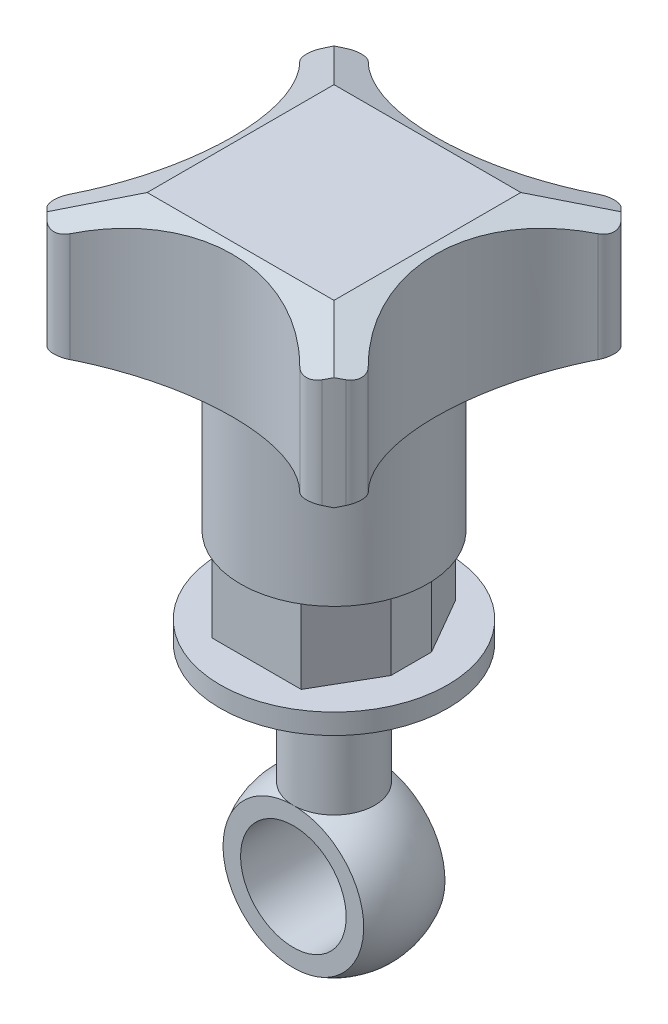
ISO-10303-21;
HEADER;
FILE_DESCRIPTION(('STEP AP214'),'2;1');
FILE_NAME('part.step','',(''),(''),'','','');
FILE_SCHEMA(('AUTOMOTIVE_DESIGN { 1 0 10303 214 1 1 1 1 }'));
ENDSEC;
DATA;
#1=APPLICATION_CONTEXT('core data for automotive mechanical design processes');
#2=APPLICATION_PROTOCOL_DEFINITION('international standard','automotive_design',2000,#1);
#3=PRODUCT_CONTEXT('',#1,'mechanical');
#4=PRODUCT('Part','Part','',(#3));
#5=PRODUCT_RELATED_PRODUCT_CATEGORY('part','',(#4));
#6=PRODUCT_DEFINITION_FORMATION('','',#4);
#7=PRODUCT_DEFINITION_CONTEXT('part definition',#1,'design');
#8=PRODUCT_DEFINITION('design','',#6,#7);
#9=PRODUCT_DEFINITION_SHAPE('','',#8);
#10=(LENGTH_UNIT() NAMED_UNIT(*) SI_UNIT(.MILLI.,.METRE.));
#11=(NAMED_UNIT(*) PLANE_ANGLE_UNIT() SI_UNIT($,.RADIAN.));
#12=(NAMED_UNIT(*) SI_UNIT($,.STERADIAN.) SOLID_ANGLE_UNIT());
#13=UNCERTAINTY_MEASURE_WITH_UNIT(LENGTH_MEASURE(1.E-05),#10,'distance_accuracy_value','');
#14=(GEOMETRIC_REPRESENTATION_CONTEXT(3) GLOBAL_UNCERTAINTY_ASSIGNED_CONTEXT((#13)) GLOBAL_UNIT_ASSIGNED_CONTEXT((#10,
#11,#12)) REPRESENTATION_CONTEXT('',''));
#15=CARTESIAN_POINT('',(0.,0.,0.));
#16=DIRECTION('',(0.,0.,1.));
#17=DIRECTION('',(1.,0.,0.));
#18=AXIS2_PLACEMENT_3D('',#15,#16,#17);
#19=CARTESIAN_POINT('',(13.5,161.5,-100.));
#20=DIRECTION('',(0.,-1.,0.));
#21=DIRECTION('',(0.,0.,-1.));
#22=AXIS2_PLACEMENT_3D('',#19,#20,#21);
#23=PLANE('',#22);
#24=DIRECTION('',(-0.499481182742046,0.,0.866324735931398));
#25=VECTOR('',#24,1.);
#26=CARTESIAN_POINT('',(30.4601744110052,161.5,-15.5000000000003));
#27=LINE('',#26,#25);
#28=CARTESIAN_POINT('',(34.4999999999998,161.5,-22.5068722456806));
#29=VERTEX_POINT('',#28);
#30=CARTESIAN_POINT('',(30.460174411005,161.5,-15.5));
#31=VERTEX_POINT('',#30);
#32=EDGE_CURVE('E348',#29,#31,#27,.T.);
#33=ORIENTED_EDGE('',*,*,#32,.F.);
#34=DIRECTION('',(0.,0.,1.));
#35=VECTOR('',#34,1.);
#36=CARTESIAN_POINT('',(34.4999999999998,161.5,-99.9999999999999));
#37=LINE('',#36,#35);
#38=CARTESIAN_POINT('',(34.5,161.5,-27.5076538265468));
#39=VERTEX_POINT('',#38);
#40=EDGE_CURVE('E428',#39,#29,#37,.T.);
#41=ORIENTED_EDGE('',*,*,#40,.F.);
#42=DIRECTION('',(0.50025934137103,0.,0.865875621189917));
#43=VECTOR('',#42,1.);
#44=CARTESIAN_POINT('',(35.943100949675,161.5,-25.0098575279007));
#45=LINE('',#44,#43);
#46=CARTESIAN_POINT('',(30.4601744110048,161.5,-34.5));
#47=VERTEX_POINT('',#46);
#48=EDGE_CURVE('E353',#47,#39,#45,.T.);
#49=ORIENTED_EDGE('',*,*,#48,.F.);
#50=DIRECTION('',(-1.,0.,0.));
#51=VECTOR('',#50,1.);
#52=CARTESIAN_POINT('',(200.,161.5,-34.5));
#53=LINE('',#52,#51);
#54=CARTESIAN_POINT('',(19.477243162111,161.5,-34.5));
#55=VERTEX_POINT('',#54);
#56=EDGE_CURVE('E388',#47,#55,#53,.T.);
#57=ORIENTED_EDGE('',*,*,#56,.T.);
#58=DIRECTION('',(0.499481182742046,0.,-0.866324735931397));
#59=VECTOR('',#58,1.);
#60=CARTESIAN_POINT('',(19.4800841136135,161.5,-34.5049274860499));
#61=LINE('',#60,#59);
#62=CARTESIAN_POINT('',(15.4999999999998,161.5,-27.601673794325));
#63=VERTEX_POINT('',#62);
#64=EDGE_CURVE('E566',#63,#55,#61,.T.);
#65=ORIENTED_EDGE('',*,*,#64,.F.);
#66=DIRECTION('',(0.,0.,1.));
#67=VECTOR('',#66,1.);
#68=CARTESIAN_POINT('',(15.4999999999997,161.5,-100.));
#69=LINE('',#68,#67);
#70=CARTESIAN_POINT('',(15.5,161.5,-22.40371978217));
#71=VERTEX_POINT('',#70);
#72=EDGE_CURVE('E438',#63,#71,#69,.T.);
#73=ORIENTED_EDGE('',*,*,#72,.T.);
#74=DIRECTION('',(-0.50025934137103,0.,-0.865875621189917));
#75=VECTOR('',#74,1.);
#76=CARTESIAN_POINT('',(13.9999999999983,161.5,-24.9999999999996));
#77=LINE('',#76,#75);
#78=CARTESIAN_POINT('',(19.4886217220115,161.5,-15.4999999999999));
#79=VERTEX_POINT('',#78);
#80=EDGE_CURVE('E570',#79,#71,#77,.T.);
#81=ORIENTED_EDGE('',*,*,#80,.F.);
#82=DIRECTION('',(-1.,0.,0.));
#83=VECTOR('',#82,1.);
#84=CARTESIAN_POINT('',(200.,161.5,-15.5000000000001));
#85=LINE('',#84,#83);
#86=EDGE_CURVE('E359',#31,#79,#85,.T.);
#87=ORIENTED_EDGE('',*,*,#86,.F.);
#88=EDGE_LOOP('',(#33,#41,#49,#57,#65,#73,#81,#87));
#89=FACE_BOUND('',#88,.T.);
#90=CARTESIAN_POINT('',(24.9999999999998,161.5,-25.));
#91=DIRECTION('',(0.,-1.,0.));
#92=DIRECTION('',(0.,0.,-1.));
#93=AXIS2_PLACEMENT_3D('',#90,#91,#92);
#94=CIRCLE('',#93,11.5);
#95=CARTESIAN_POINT('',(24.9999999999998,161.5,-36.5));
#96=VERTEX_POINT('',#95);
#97=EDGE_CURVE('E515',#96,#96,#94,.T.);
#98=ORIENTED_EDGE('',*,*,#97,.T.);
#99=EDGE_LOOP('',(#98));
#100=FACE_BOUND('',#99,.T.);
#101=ADVANCED_FACE('F101',(#89,#100),#23,.T.);
#102=CARTESIAN_POINT('',(34.4999999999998,161.5,-99.9999999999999));
#103=DIRECTION('',(1.,0.,0.));
#104=DIRECTION('',(0.,0.,-1.));
#105=AXIS2_PLACEMENT_3D('',#102,#103,#104);
#106=PLANE('',#105);
#107=DIRECTION('',(0.,1.,0.));
#108=VECTOR('',#107,1.);
#109=CARTESIAN_POINT('',(34.4999999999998,161.499999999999,-22.5068722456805));
#110=LINE('',#109,#108);
#111=CARTESIAN_POINT('',(34.4999999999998,152.,-22.5068722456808));
#112=VERTEX_POINT('',#111);
#113=EDGE_CURVE('E580',#112,#29,#110,.T.);
#114=ORIENTED_EDGE('',*,*,#113,.F.);
#115=DIRECTION('',(0.,0.,1.));
#116=VECTOR('',#115,1.);
#117=CARTESIAN_POINT('',(34.5,152.,-100.));
#118=LINE('',#117,#116);
#119=CARTESIAN_POINT('',(34.5,152.,-27.5076538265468));
#120=VERTEX_POINT('',#119);
#121=EDGE_CURVE('E337',#120,#112,#118,.T.);
#122=ORIENTED_EDGE('',*,*,#121,.F.);
#123=DIRECTION('',(0.,-1.,0.));
#124=VECTOR('',#123,1.);
#125=CARTESIAN_POINT('',(34.5,161.500000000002,-27.5076538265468));
#126=LINE('',#125,#124);
#127=EDGE_CURVE('E569',#39,#120,#126,.T.);
#128=ORIENTED_EDGE('',*,*,#127,.F.);
#129=ORIENTED_EDGE('',*,*,#40,.T.);
#130=EDGE_LOOP('',(#114,#122,#128,#129));
#131=FACE_BOUND('',#130,.T.);
#132=ADVANCED_FACE('F846',(#131),#106,.T.);
#133=CARTESIAN_POINT('',(15.4999999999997,152.,-100.));
#134=DIRECTION('',(-1.,0.,0.));
#135=DIRECTION('',(0.,0.,1.));
#136=AXIS2_PLACEMENT_3D('',#133,#134,#135);
#137=PLANE('',#136);
#138=DIRECTION('',(0.,1.,0.));
#139=VECTOR('',#138,1.);
#140=CARTESIAN_POINT('',(15.4999999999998,151.999999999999,-27.6016737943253));
#141=LINE('',#140,#139);
#142=CARTESIAN_POINT('',(15.4999999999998,152.,-27.6016737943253));
#143=VERTEX_POINT('',#142);
#144=EDGE_CURVE('E578',#143,#63,#141,.T.);
#145=ORIENTED_EDGE('',*,*,#144,.F.);
#146=DIRECTION('',(0.,0.,1.));
#147=VECTOR('',#146,1.);
#148=CARTESIAN_POINT('',(15.4999999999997,152.,-100.));
#149=LINE('',#148,#147);
#150=CARTESIAN_POINT('',(15.4999999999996,152.,-22.40371978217));
#151=VERTEX_POINT('',#150);
#152=EDGE_CURVE('E434',#143,#151,#149,.T.);
#153=ORIENTED_EDGE('',*,*,#152,.T.);
#154=DIRECTION('',(0.,-1.,0.));
#155=VECTOR('',#154,1.);
#156=CARTESIAN_POINT('',(15.4999999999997,152.000000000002,-22.4037197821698));
#157=LINE('',#156,#155);
#158=EDGE_CURVE('E583',#71,#151,#157,.T.);
#159=ORIENTED_EDGE('',*,*,#158,.F.);
#160=ORIENTED_EDGE('',*,*,#72,.F.);
#161=EDGE_LOOP('',(#145,#153,#159,#160));
#162=FACE_BOUND('',#161,.T.);
#163=ADVANCED_FACE('F852',(#162),#137,.T.);
#164=CARTESIAN_POINT('',(200.,152.,-15.5));
#165=DIRECTION('',(0.,0.,-1.));
#166=DIRECTION('',(-1.,0.,0.));
#167=AXIS2_PLACEMENT_3D('',#164,#165,#166);
#168=PLANE('',#167);
#169=ORIENTED_EDGE('',*,*,#86,.T.);
#170=DIRECTION('',(0.,-1.,0.));
#171=VECTOR('',#170,1.);
#172=CARTESIAN_POINT('',(19.4886217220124,238.965720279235,-15.5));
#173=LINE('',#172,#171);
#174=CARTESIAN_POINT('',(19.4886217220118,152.,-15.4999999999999));
#175=VERTEX_POINT('',#174);
#176=EDGE_CURVE('E354',#79,#175,#173,.T.);
#177=ORIENTED_EDGE('',*,*,#176,.T.);
#178=DIRECTION('',(-1.,0.,0.));
#179=VECTOR('',#178,1.);
#180=CARTESIAN_POINT('',(200.,152.,-15.5));
#181=LINE('',#180,#179);
#182=CARTESIAN_POINT('',(30.4601744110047,152.,-15.4999999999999));
#183=VERTEX_POINT('',#182);
#184=EDGE_CURVE('E334',#183,#175,#181,.T.);
#185=ORIENTED_EDGE('',*,*,#184,.F.);
#186=DIRECTION('',(0.,-1.,0.));
#187=VECTOR('',#186,1.);
#188=CARTESIAN_POINT('',(30.4601744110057,238.965720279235,-15.4999999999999));
#189=LINE('',#188,#187);
#190=EDGE_CURVE('E345',#31,#183,#189,.T.);
#191=ORIENTED_EDGE('',*,*,#190,.F.);
#192=EDGE_LOOP('',(#169,#177,#185,#191));
#193=FACE_BOUND('',#192,.T.);
#194=ADVANCED_FACE('F357',(#193),#168,.F.);
#195=CARTESIAN_POINT('',(200.,161.5,-34.5));
#196=DIRECTION('',(0.,0.,1.));
#197=DIRECTION('',(1.,0.,0.));
#198=AXIS2_PLACEMENT_3D('',#195,#196,#197);
#199=PLANE('',#198);
#200=DIRECTION('',(-1.,0.,0.));
#201=VECTOR('',#200,1.);
#202=CARTESIAN_POINT('',(200.,152.,-34.5));
#203=LINE('',#202,#201);
#204=CARTESIAN_POINT('',(30.4601744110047,152.,-34.5));
#205=VERTEX_POINT('',#204);
#206=CARTESIAN_POINT('',(19.4772431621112,152.,-34.5));
#207=VERTEX_POINT('',#206);
#208=EDGE_CURVE('E392',#205,#207,#203,.T.);
#209=ORIENTED_EDGE('',*,*,#208,.T.);
#210=DIRECTION('',(0.,1.,0.));
#211=VECTOR('',#210,1.);
#212=CARTESIAN_POINT('',(19.477243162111,161.500000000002,-34.5000000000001));
#213=LINE('',#212,#211);
#214=EDGE_CURVE('E13',#207,#55,#213,.T.);
#215=ORIENTED_EDGE('',*,*,#214,.T.);
#216=ORIENTED_EDGE('',*,*,#56,.F.);
#217=DIRECTION('',(0.,-1.,0.));
#218=VECTOR('',#217,1.);
#219=CARTESIAN_POINT('',(30.4601744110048,161.500000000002,-34.5));
#220=LINE('',#219,#218);
#221=EDGE_CURVE('E111',#47,#205,#220,.T.);
#222=ORIENTED_EDGE('',*,*,#221,.T.);
#223=EDGE_LOOP('',(#209,#215,#216,#222));
#224=FACE_BOUND('',#223,.T.);
#225=ADVANCED_FACE('F876',(#224),#199,.F.);
#226=CARTESIAN_POINT('',(35.9431009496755,238.965720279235,-25.0098575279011));
#227=DIRECTION('',(-0.865875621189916,0.,0.50025934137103));
#228=DIRECTION('',(0.50025934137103,0.,0.865875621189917));
#229=AXIS2_PLACEMENT_3D('',#226,#227,#228);
#230=PLANE('',#229);
#231=ORIENTED_EDGE('',*,*,#127,.T.);
#232=DIRECTION('',(-0.50025934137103,0.,-0.865875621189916));
#233=VECTOR('',#232,1.);
#234=CARTESIAN_POINT('',(35.9431009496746,152.,-25.009857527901));
#235=LINE('',#234,#233);
#236=EDGE_CURVE('E341',#120,#205,#235,.T.);
#237=ORIENTED_EDGE('',*,*,#236,.T.);
#238=ORIENTED_EDGE('',*,*,#221,.F.);
#239=ORIENTED_EDGE('',*,*,#48,.T.);
#240=EDGE_LOOP('',(#231,#237,#238,#239));
#241=FACE_BOUND('',#240,.T.);
#242=ADVANCED_FACE('F878',(#241),#230,.F.);
#243=CARTESIAN_POINT('',(19.4800841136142,238.965720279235,-34.5049274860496));
#244=DIRECTION('',(0.866324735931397,0.,0.499481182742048));
#245=DIRECTION('',(0.499481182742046,0.,-0.866324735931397));
#246=AXIS2_PLACEMENT_3D('',#243,#244,#245);
#247=PLANE('',#246);
#248=ORIENTED_EDGE('',*,*,#144,.T.);
#249=ORIENTED_EDGE('',*,*,#64,.T.);
#250=ORIENTED_EDGE('',*,*,#214,.F.);
#251=DIRECTION('',(-0.499481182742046,0.,0.866324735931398));
#252=VECTOR('',#251,1.);
#253=CARTESIAN_POINT('',(19.4800841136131,152.,-34.5049274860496));
#254=LINE('',#253,#252);
#255=EDGE_CURVE('E553',#207,#143,#254,.T.);
#256=ORIENTED_EDGE('',*,*,#255,.T.);
#257=EDGE_LOOP('',(#248,#249,#250,#256));
#258=FACE_BOUND('',#257,.T.);
#259=ADVANCED_FACE('F926',(#258),#247,.F.);
#260=CARTESIAN_POINT('',(13.999999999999,238.965720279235,-25.));
#261=DIRECTION('',(0.865875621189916,0.,-0.50025934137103));
#262=DIRECTION('',(-0.50025934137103,0.,-0.865875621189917));
#263=AXIS2_PLACEMENT_3D('',#260,#261,#262);
#264=PLANE('',#263);
#265=ORIENTED_EDGE('',*,*,#158,.T.);
#266=DIRECTION('',(0.50025934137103,0.,0.865875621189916));
#267=VECTOR('',#266,1.);
#268=CARTESIAN_POINT('',(13.9999999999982,152.,-24.9999999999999));
#269=LINE('',#268,#267);
#270=EDGE_CURVE('E342',#151,#175,#269,.T.);
#271=ORIENTED_EDGE('',*,*,#270,.T.);
#272=ORIENTED_EDGE('',*,*,#176,.F.);
#273=ORIENTED_EDGE('',*,*,#80,.T.);
#274=EDGE_LOOP('',(#265,#271,#272,#273));
#275=FACE_BOUND('',#274,.T.);
#276=ADVANCED_FACE('F930',(#275),#264,.F.);
#277=CARTESIAN_POINT('',(30.4601744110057,238.965720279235,-15.4999999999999));
#278=DIRECTION('',(-0.866324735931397,0.,-0.499481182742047));
#279=DIRECTION('',(-0.499481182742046,0.,0.866324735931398));
#280=AXIS2_PLACEMENT_3D('',#277,#278,#279);
#281=PLANE('',#280);
#282=ORIENTED_EDGE('',*,*,#113,.T.);
#283=ORIENTED_EDGE('',*,*,#32,.T.);
#284=ORIENTED_EDGE('',*,*,#190,.T.);
#285=DIRECTION('',(0.499481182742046,0.,-0.866324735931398));
#286=VECTOR('',#285,1.);
#287=CARTESIAN_POINT('',(30.4601744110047,152.,-15.5));
#288=LINE('',#287,#286);
#289=EDGE_CURVE('E330',#183,#112,#288,.T.);
#290=ORIENTED_EDGE('',*,*,#289,.T.);
#291=EDGE_LOOP('',(#282,#283,#284,#290));
#292=FACE_BOUND('',#291,.T.);
#293=ADVANCED_FACE('F346',(#292),#281,.F.);
#294=CARTESIAN_POINT('',(38.7788461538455,179.5,-25.));
#295=DIRECTION('',(0.,-1.,0.));
#296=DIRECTION('',(0.,0.,-1.));
#297=AXIS2_PLACEMENT_3D('',#294,#295,#296);
#298=PLANE('',#297);
#299=DIRECTION('',(-1.,0.,0.));
#300=VECTOR('',#299,1.);
#301=CARTESIAN_POINT('',(200.,179.5,-13.5));
#302=LINE('',#301,#300);
#303=CARTESIAN_POINT('',(25.,179.5,-13.5));
#304=VERTEX_POINT('',#303);
#305=CARTESIAN_POINT('',(13.5000000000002,179.5,-13.5000000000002));
#306=VERTEX_POINT('',#305);
#307=EDGE_CURVE('E550',#304,#306,#302,.T.);
#308=ORIENTED_EDGE('',*,*,#307,.T.);
#309=DIRECTION('',(0.,0.,1.));
#310=VECTOR('',#309,1.);
#311=CARTESIAN_POINT('',(13.5,179.5,-100.));
#312=LINE('',#311,#310);
#313=CARTESIAN_POINT('',(13.4999999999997,179.5,-25.));
#314=VERTEX_POINT('',#313);
#315=EDGE_CURVE('E546',#314,#306,#312,.T.);
#316=ORIENTED_EDGE('',*,*,#315,.F.);
#317=CARTESIAN_POINT('',(25.,179.5,-24.9999999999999));
#318=DIRECTION('',(0.,-1.,0.));
#319=DIRECTION('',(0.,0.,-1.));
#320=AXIS2_PLACEMENT_3D('',#317,#318,#319);
#321=CIRCLE('',#320,11.5);
#322=EDGE_CURVE('E775',#304,#314,#321,.T.);
#323=ORIENTED_EDGE('',*,*,#322,.F.);
#324=EDGE_LOOP('',(#308,#316,#323));
#325=FACE_BOUND('',#324,.T.);
#326=ADVANCED_FACE('F776',(#325),#298,.T.);
#327=DIRECTION('',(-1.,0.,0.));
#328=VECTOR('',#327,1.);
#329=CARTESIAN_POINT('',(200.,179.5,-13.5));
#330=LINE('',#329,#328);
#331=CARTESIAN_POINT('',(36.4999999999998,179.5,-13.5));
#332=VERTEX_POINT('',#331);
#333=EDGE_CURVE('E365',#332,#304,#330,.T.);
#334=ORIENTED_EDGE('',*,*,#333,.T.);
#335=CARTESIAN_POINT('',(36.4999999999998,179.5,-25.));
#336=VERTEX_POINT('',#335);
#337=EDGE_CURVE('E542',#336,#304,#321,.T.);
#338=ORIENTED_EDGE('',*,*,#337,.F.);
#339=DIRECTION('',(0.,0.,-1.));
#340=VECTOR('',#339,1.);
#341=CARTESIAN_POINT('',(36.4999999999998,179.5,-100.));
#342=LINE('',#341,#340);
#343=EDGE_CURVE('E541',#332,#336,#342,.T.);
#344=ORIENTED_EDGE('',*,*,#343,.F.);
#345=EDGE_LOOP('',(#334,#338,#344));
#346=FACE_BOUND('',#345,.T.);
#347=ADVANCED_FACE('F771',(#346),#298,.T.);
#348=CARTESIAN_POINT('',(24.9999999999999,179.5,-36.5));
#349=VERTEX_POINT('',#348);
#350=EDGE_CURVE('E537',#349,#336,#321,.T.);
#351=ORIENTED_EDGE('',*,*,#350,.F.);
#352=DIRECTION('',(-1.,0.,0.));
#353=VECTOR('',#352,1.);
#354=CARTESIAN_POINT('',(200.,179.5,-36.4999999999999));
#355=LINE('',#354,#353);
#356=CARTESIAN_POINT('',(36.4999999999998,179.5,-36.5));
#357=VERTEX_POINT('',#356);
#358=EDGE_CURVE('E384',#357,#349,#355,.T.);
#359=ORIENTED_EDGE('',*,*,#358,.F.);
#360=DIRECTION('',(0.,0.,1.));
#361=VECTOR('',#360,1.);
#362=CARTESIAN_POINT('',(36.4999999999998,179.5,-100.));
#363=LINE('',#362,#361);
#364=EDGE_CURVE('E425',#357,#336,#363,.T.);
#365=ORIENTED_EDGE('',*,*,#364,.T.);
#366=EDGE_LOOP('',(#351,#359,#365));
#367=FACE_BOUND('',#366,.T.);
#368=ADVANCED_FACE('F795',(#367),#298,.T.);
#369=CARTESIAN_POINT('',(25.,179.5,-24.9999999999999));
#370=DIRECTION('',(0.,-1.,0.));
#371=DIRECTION('',(0.,0.,-1.));
#372=AXIS2_PLACEMENT_3D('',#369,#370,#371);
#373=CYLINDRICAL_SURFACE('',#372,11.5);
#374=ORIENTED_EDGE('',*,*,#97,.F.);
#375=EDGE_LOOP('',(#374));
#376=FACE_BOUND('',#375,.T.);
#377=ORIENTED_EDGE('',*,*,#350,.T.);
#378=ORIENTED_EDGE('',*,*,#337,.T.);
#379=ORIENTED_EDGE('',*,*,#322,.T.);
#380=EDGE_CURVE('E536',#314,#349,#321,.T.);
#381=ORIENTED_EDGE('',*,*,#380,.T.);
#382=EDGE_LOOP('',(#377,#378,#379,#381));
#383=FACE_BOUND('',#382,.T.);
#384=ADVANCED_FACE('F780',(#376,#383),#373,.T.);
#385=CARTESIAN_POINT('',(13.5,179.5,-36.5));
#386=VERTEX_POINT('',#385);
#387=EDGE_CURVE('E383',#349,#386,#355,.T.);
#388=ORIENTED_EDGE('',*,*,#387,.F.);
#389=ORIENTED_EDGE('',*,*,#380,.F.);
#390=DIRECTION('',(0.,0.,1.));
#391=VECTOR('',#390,1.);
#392=CARTESIAN_POINT('',(13.4999999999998,179.5,-100.));
#393=LINE('',#392,#391);
#394=EDGE_CURVE('E442',#386,#314,#393,.T.);
#395=ORIENTED_EDGE('',*,*,#394,.F.);
#396=EDGE_LOOP('',(#388,#389,#395));
#397=FACE_BOUND('',#396,.T.);
#398=ADVANCED_FACE('F786',(#397),#298,.T.);
#399=CARTESIAN_POINT('',(13.4999999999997,197.5,-99.9999999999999));
#400=DIRECTION('',(0.,1.,0.));
#401=DIRECTION('',(0.,0.,1.));
#402=AXIS2_PLACEMENT_3D('',#399,#400,#401);
#403=PLANE('',#402);
#404=DIRECTION('',(-1.,0.,0.));
#405=VECTOR('',#404,1.);
#406=CARTESIAN_POINT('',(200.,197.5,-36.5));
#407=LINE('',#406,#405);
#408=CARTESIAN_POINT('',(36.4999999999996,197.5,-36.5));
#409=VERTEX_POINT('',#408);
#410=CARTESIAN_POINT('',(13.5,197.5,-36.5));
#411=VERTEX_POINT('',#410);
#412=EDGE_CURVE('E379',#409,#411,#407,.T.);
#413=ORIENTED_EDGE('',*,*,#412,.T.);
#414=DIRECTION('',(0.,0.,1.));
#415=VECTOR('',#414,1.);
#416=CARTESIAN_POINT('',(13.4999999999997,197.5,-99.9999999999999));
#417=LINE('',#416,#415);
#418=CARTESIAN_POINT('',(13.4999999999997,197.5,-13.5));
#419=VERTEX_POINT('',#418);
#420=EDGE_CURVE('E419',#411,#419,#417,.T.);
#421=ORIENTED_EDGE('',*,*,#420,.T.);
#422=DIRECTION('',(-1.,0.,0.));
#423=VECTOR('',#422,1.);
#424=CARTESIAN_POINT('',(200.,197.5,-13.5));
#425=LINE('',#424,#423);
#426=CARTESIAN_POINT('',(36.4999999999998,197.5,-13.4999999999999));
#427=VERTEX_POINT('',#426);
#428=EDGE_CURVE('E375',#427,#419,#425,.T.);
#429=ORIENTED_EDGE('',*,*,#428,.F.);
#430=DIRECTION('',(0.,0.,1.));
#431=VECTOR('',#430,1.);
#432=CARTESIAN_POINT('',(36.4999999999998,197.5,-99.9999999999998));
#433=LINE('',#432,#431);
#434=EDGE_CURVE('E420',#409,#427,#433,.T.);
#435=ORIENTED_EDGE('',*,*,#434,.F.);
#436=EDGE_LOOP('',(#413,#421,#429,#435));
#437=FACE_BOUND('',#436,.T.);
#438=ADVANCED_FACE('F103',(#437),#403,.T.);
#439=CARTESIAN_POINT('',(200.,197.5,-13.5));
#440=DIRECTION('',(0.,-0.948683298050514,-0.316227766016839));
#441=DIRECTION('',(0.,0.316227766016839,-0.948683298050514));
#442=AXIS2_PLACEMENT_3D('',#439,#440,#441);
#443=PLANE('',#442);
#444=CARTESIAN_POINT('',(24.9999999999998,201.333333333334,-25.));
#445=DIRECTION('',(0.,-0.948683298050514,-0.316227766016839));
#446=DIRECTION('',(0.,0.316227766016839,-0.948683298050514));
#447=AXIS2_PLACEMENT_3D('',#444,#445,#446);
#448=ELLIPSE('',#447,26.3523138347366,25.0000000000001);
#449=CARTESIAN_POINT('',(8.09238483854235,195.194816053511,-6.5844481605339));
#450=VERTEX_POINT('',#449);
#451=CARTESIAN_POINT('',(7.32233047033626,195.440776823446,-7.32233047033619));
#452=VERTEX_POINT('',#451);
#453=EDGE_CURVE('E485',#450,#452,#448,.T.);
#454=ORIENTED_EDGE('',*,*,#453,.F.);
#455=CARTESIAN_POINT('',(9.44499405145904,195.685897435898,-8.05769230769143));
#456=DIRECTION('',(0.,-0.948683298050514,-0.316227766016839));
#457=DIRECTION('',(0.,0.316227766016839,-0.948683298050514));
#458=AXIS2_PLACEMENT_3D('',#455,#456,#457);
#459=ELLIPSE('',#458,2.10818510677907,2.00000000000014);
#460=CARTESIAN_POINT('',(10.8590855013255,195.214452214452,-6.64335664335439));
#461=VERTEX_POINT('',#460);
#462=EDGE_CURVE('E482',#461,#450,#459,.T.);
#463=ORIENTED_EDGE('',*,*,#462,.F.);
#464=CARTESIAN_POINT('',(24.999999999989,190.499999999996,7.50000000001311));
#465=DIRECTION('',(0.,-0.948683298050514,-0.316227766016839));
#466=DIRECTION('',(0.,0.316227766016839,-0.948683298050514));
#467=AXIS2_PLACEMENT_3D('',#464,#465,#466);
#468=ELLIPSE('',#467,21.0818510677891,19.9999999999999);
#469=CARTESIAN_POINT('',(39.1409144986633,195.214452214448,-6.64335664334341));
#470=VERTEX_POINT('',#469);
#471=EDGE_CURVE('E478',#461,#470,#468,.T.);
#472=ORIENTED_EDGE('',*,*,#471,.T.);
#473=CARTESIAN_POINT('',(40.5550059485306,195.685897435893,-8.05769230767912));
#474=DIRECTION('',(0.,-0.948683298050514,-0.316227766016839));
#475=DIRECTION('',(0.,0.316227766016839,-0.948683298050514));
#476=AXIS2_PLACEMENT_3D('',#473,#474,#475);
#477=ELLIPSE('',#476,2.1081851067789,1.99999999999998);
#478=CARTESIAN_POINT('',(41.9076151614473,195.194816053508,-6.58444816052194));
#479=VERTEX_POINT('',#478);
#480=EDGE_CURVE('E475',#479,#470,#477,.T.);
#481=ORIENTED_EDGE('',*,*,#480,.F.);
#482=CARTESIAN_POINT('',(24.9999999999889,201.333333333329,-24.9999999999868));
#483=DIRECTION('',(0.,-0.948683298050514,-0.316227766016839));
#484=DIRECTION('',(0.,0.316227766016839,-0.948683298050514));
#485=AXIS2_PLACEMENT_3D('',#482,#483,#484);
#486=ELLIPSE('',#485,26.3523138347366,25.0000000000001);
#487=CARTESIAN_POINT('',(42.6776695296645,195.440776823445,-7.32233047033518));
#488=VERTEX_POINT('',#487);
#489=EDGE_CURVE('E472',#488,#479,#486,.T.);
#490=ORIENTED_EDGE('',*,*,#489,.F.);
#491=DIRECTION('',(-0.688247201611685,0.229415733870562,-0.688247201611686));
#492=VECTOR('',#491,1.);
#493=CARTESIAN_POINT('',(-4.4736842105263,211.157894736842,-54.4736842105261));
#494=LINE('',#493,#492);
#495=EDGE_CURVE('E408',#488,#427,#494,.T.);
#496=ORIENTED_EDGE('',*,*,#495,.T.);
#497=ORIENTED_EDGE('',*,*,#428,.T.);
#498=DIRECTION('',(-0.688247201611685,-0.229415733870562,0.688247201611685));
#499=VECTOR('',#498,1.);
#500=CARTESIAN_POINT('',(54.4736842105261,211.157894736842,-54.4736842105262));
#501=LINE('',#500,#499);
#502=EDGE_CURVE('E404',#419,#452,#501,.T.);
#503=ORIENTED_EDGE('',*,*,#502,.T.);
#504=EDGE_LOOP('',(#454,#463,#472,#481,#490,#496,#497,#503));
#505=FACE_BOUND('',#504,.T.);
#506=ADVANCED_FACE('F748',(#505),#443,.F.);
#507=CARTESIAN_POINT('',(13.4999999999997,197.5,-99.9999999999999));
#508=DIRECTION('',(-0.316227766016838,0.948683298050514,0.));
#509=DIRECTION('',(-0.948683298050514,-0.316227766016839,0.));
#510=AXIS2_PLACEMENT_3D('',#507,#508,#509);
#511=PLANE('',#510);
#512=CARTESIAN_POINT('',(8.05769230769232,195.685897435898,-9.44499405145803));
#513=DIRECTION('',(-0.316227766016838,0.948683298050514,0.));
#514=DIRECTION('',(0.948683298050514,0.316227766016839,0.));
#515=AXIS2_PLACEMENT_3D('',#512,#513,#514);
#516=ELLIPSE('',#515,2.1081851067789,1.99999999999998);
#517=CARTESIAN_POINT('',(6.64335664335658,195.214452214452,-10.8590855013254));
#518=VERTEX_POINT('',#517);
#519=CARTESIAN_POINT('',(6.58444816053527,195.194816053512,-8.09238483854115));
#520=VERTEX_POINT('',#519);
#521=EDGE_CURVE('E488',#518,#520,#516,.T.);
#522=ORIENTED_EDGE('',*,*,#521,.T.);
#523=CARTESIAN_POINT('',(24.9999999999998,201.333333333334,-25.));
#524=DIRECTION('',(-0.316227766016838,0.948683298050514,0.));
#525=DIRECTION('',(0.948683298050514,0.316227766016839,0.));
#526=AXIS2_PLACEMENT_3D('',#523,#524,#525);
#527=ELLIPSE('',#526,26.3523138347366,25.0000000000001);
#528=EDGE_CURVE('E702',#520,#452,#527,.T.);
#529=ORIENTED_EDGE('',*,*,#528,.T.);
#530=ORIENTED_EDGE('',*,*,#502,.F.);
#531=ORIENTED_EDGE('',*,*,#420,.F.);
#532=DIRECTION('',(0.688247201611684,0.229415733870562,0.688247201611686));
#533=VECTOR('',#532,1.);
#534=CARTESIAN_POINT('',(-16.5789473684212,187.473684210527,-66.5789473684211));
#535=LINE('',#534,#533);
#536=CARTESIAN_POINT('',(7.32233047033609,195.440776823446,-42.6776695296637));
#537=VERTEX_POINT('',#536);
#538=EDGE_CURVE('E424',#537,#411,#535,.T.);
#539=ORIENTED_EDGE('',*,*,#538,.F.);
#540=CARTESIAN_POINT('',(24.9999999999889,201.33333333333,-24.9999999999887));
#541=DIRECTION('',(-0.316227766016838,0.948683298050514,0.));
#542=DIRECTION('',(0.948683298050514,0.316227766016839,0.));
#543=AXIS2_PLACEMENT_3D('',#540,#541,#542);
#544=ELLIPSE('',#543,26.3523138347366,25.0000000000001);
#545=CARTESIAN_POINT('',(6.58444816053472,195.194816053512,-41.9076151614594));
#546=VERTEX_POINT('',#545);
#547=EDGE_CURVE('E657',#537,#546,#544,.T.);
#548=ORIENTED_EDGE('',*,*,#547,.T.);
#549=CARTESIAN_POINT('',(8.05769230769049,195.685897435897,-40.5550059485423));
#550=DIRECTION('',(-0.316227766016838,0.948683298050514,0.));
#551=DIRECTION('',(0.948683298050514,0.316227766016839,0.));
#552=AXIS2_PLACEMENT_3D('',#549,#550,#551);
#553=ELLIPSE('',#552,2.10818510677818,1.9999999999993);
#554=CARTESIAN_POINT('',(6.64335664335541,195.214452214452,-39.1409144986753));
#555=VERTEX_POINT('',#554);
#556=EDGE_CURVE('E495',#546,#555,#553,.T.);
#557=ORIENTED_EDGE('',*,*,#556,.T.);
#558=CARTESIAN_POINT('',(-7.4999999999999,190.5,-24.9999999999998));
#559=DIRECTION('',(-0.316227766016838,0.948683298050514,0.));
#560=DIRECTION('',(0.948683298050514,0.316227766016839,0.));
#561=AXIS2_PLACEMENT_3D('',#558,#559,#560);
#562=ELLIPSE('',#561,21.0818510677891,19.9999999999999);
#563=EDGE_CURVE('E492',#518,#555,#562,.T.);
#564=ORIENTED_EDGE('',*,*,#563,.F.);
#565=EDGE_LOOP('',(#522,#529,#530,#531,#539,#548,#557,#564));
#566=FACE_BOUND('',#565,.T.);
#567=ADVANCED_FACE('F820',(#566),#511,.T.);
#568=CARTESIAN_POINT('',(36.4999999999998,197.5,-99.9999999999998));
#569=DIRECTION('',(0.316227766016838,0.948683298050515,0.));
#570=DIRECTION('',(-0.948683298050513,0.316227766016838,0.));
#571=AXIS2_PLACEMENT_3D('',#568,#569,#570);
#572=PLANE('',#571);
#573=ORIENTED_EDGE('',*,*,#495,.F.);
#574=CARTESIAN_POINT('',(24.9999999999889,201.333333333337,-24.9999999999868));
#575=DIRECTION('',(0.316227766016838,0.948683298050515,0.));
#576=DIRECTION('',(-0.948683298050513,0.316227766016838,0.));
#577=AXIS2_PLACEMENT_3D('',#574,#575,#576);
#578=ELLIPSE('',#577,26.3523138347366,25.0000000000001);
#579=CARTESIAN_POINT('',(43.4155518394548,195.194816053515,-8.09238483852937));
#580=VERTEX_POINT('',#579);
#581=EDGE_CURVE('E681',#488,#580,#578,.T.);
#582=ORIENTED_EDGE('',*,*,#581,.T.);
#583=CARTESIAN_POINT('',(41.9423076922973,195.685897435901,-9.44499405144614));
#584=DIRECTION('',(0.316227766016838,0.948683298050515,0.));
#585=DIRECTION('',(-0.948683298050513,0.316227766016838,0.));
#586=AXIS2_PLACEMENT_3D('',#583,#584,#585);
#587=ELLIPSE('',#586,2.10818510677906,2.00000000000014);
#588=CARTESIAN_POINT('',(43.3566433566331,195.214452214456,-10.8590855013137));
#589=VERTEX_POINT('',#588);
#590=EDGE_CURVE('E360',#580,#589,#587,.T.);
#591=ORIENTED_EDGE('',*,*,#590,.T.);
#592=CARTESIAN_POINT('',(57.499999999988,190.500000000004,-24.9999999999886));
#593=DIRECTION('',(0.316227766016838,0.948683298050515,0.));
#594=DIRECTION('',(-0.948683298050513,0.316227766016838,0.));
#595=AXIS2_PLACEMENT_3D('',#592,#593,#594);
#596=ELLIPSE('',#595,21.0818510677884,19.9999999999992);
#597=CARTESIAN_POINT('',(43.3566433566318,195.214452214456,-39.1409144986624));
#598=VERTEX_POINT('',#597);
#599=EDGE_CURVE('E369',#598,#589,#596,.T.);
#600=ORIENTED_EDGE('',*,*,#599,.F.);
#601=CARTESIAN_POINT('',(41.9423076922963,195.685897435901,-40.5550059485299));
#602=DIRECTION('',(0.316227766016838,0.948683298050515,0.));
#603=DIRECTION('',(-0.948683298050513,0.316227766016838,0.));
#604=AXIS2_PLACEMENT_3D('',#601,#602,#603);
#605=ELLIPSE('',#604,2.10818510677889,1.99999999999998);
#606=CARTESIAN_POINT('',(43.4155518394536,195.194816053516,-41.9076151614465));
#607=VERTEX_POINT('',#606);
#608=EDGE_CURVE('E724',#598,#607,#605,.T.);
#609=ORIENTED_EDGE('',*,*,#608,.T.);
#610=CARTESIAN_POINT('',(24.9999999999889,201.333333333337,-24.9999999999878));
#611=DIRECTION('',(0.316227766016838,0.948683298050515,0.));
#612=DIRECTION('',(-0.948683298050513,0.316227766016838,0.));
#613=AXIS2_PLACEMENT_3D('',#610,#611,#612);
#614=ELLIPSE('',#613,26.3523138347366,25.0000000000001);
#615=CARTESIAN_POINT('',(42.677669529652,195.440776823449,-42.677669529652));
#616=VERTEX_POINT('',#615);
#617=EDGE_CURVE('E677',#607,#616,#614,.T.);
#618=ORIENTED_EDGE('',*,*,#617,.T.);
#619=DIRECTION('',(0.688247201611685,-0.229415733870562,-0.688247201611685));
#620=VECTOR('',#619,1.);
#621=CARTESIAN_POINT('',(66.578947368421,187.473684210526,-66.5789473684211));
#622=LINE('',#621,#620);
#623=EDGE_CURVE('E411',#409,#616,#622,.T.);
#624=ORIENTED_EDGE('',*,*,#623,.F.);
#625=ORIENTED_EDGE('',*,*,#434,.T.);
#626=EDGE_LOOP('',(#573,#582,#591,#600,#609,#618,#624,#625));
#627=FACE_BOUND('',#626,.T.);
#628=ADVANCED_FACE('F740',(#627),#572,.T.);
#629=CARTESIAN_POINT('',(200.,197.5,-36.5));
#630=DIRECTION('',(0.,-0.948683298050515,0.316227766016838));
#631=DIRECTION('',(0.,-0.316227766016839,-0.948683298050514));
#632=AXIS2_PLACEMENT_3D('',#629,#630,#631);
#633=PLANE('',#632);
#634=CARTESIAN_POINT('',(24.9999999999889,201.333333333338,-24.9999999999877));
#635=DIRECTION('',(0.,-0.948683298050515,0.316227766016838));
#636=DIRECTION('',(0.,0.316227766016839,0.948683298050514));
#637=AXIS2_PLACEMENT_3D('',#634,#635,#636);
#638=ELLIPSE('',#637,26.3523138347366,25.0000000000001);
#639=CARTESIAN_POINT('',(41.9076151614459,195.194816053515,-43.4155518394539));
#640=VERTEX_POINT('',#639);
#641=EDGE_CURVE('E674',#640,#616,#638,.T.);
#642=ORIENTED_EDGE('',*,*,#641,.F.);
#643=CARTESIAN_POINT('',(40.5550059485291,195.685897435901,-41.9423076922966));
#644=DIRECTION('',(0.,-0.948683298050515,0.316227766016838));
#645=DIRECTION('',(0.,0.316227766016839,0.948683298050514));
#646=AXIS2_PLACEMENT_3D('',#643,#644,#645);
#647=ELLIPSE('',#646,2.10818510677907,2.00000000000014);
#648=CARTESIAN_POINT('',(39.1409144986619,195.214452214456,-43.3566433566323));
#649=VERTEX_POINT('',#648);
#650=EDGE_CURVE('E668',#649,#640,#647,.T.);
#651=ORIENTED_EDGE('',*,*,#650,.F.);
#652=CARTESIAN_POINT('',(24.9999999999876,190.500000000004,-57.4999999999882));
#653=DIRECTION('',(0.,-0.948683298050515,0.316227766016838));
#654=DIRECTION('',(0.,0.316227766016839,0.948683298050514));
#655=AXIS2_PLACEMENT_3D('',#652,#653,#654);
#656=ELLIPSE('',#655,21.0818510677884,19.9999999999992);
#657=CARTESIAN_POINT('',(10.8590855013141,195.214452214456,-43.3566433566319));
#658=VERTEX_POINT('',#657);
#659=EDGE_CURVE('E664',#649,#658,#656,.T.);
#660=ORIENTED_EDGE('',*,*,#659,.T.);
#661=CARTESIAN_POINT('',(9.44499405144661,195.685897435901,-41.9423076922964));
#662=DIRECTION('',(0.,-0.948683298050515,0.316227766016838));
#663=DIRECTION('',(0.,0.316227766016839,0.948683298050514));
#664=AXIS2_PLACEMENT_3D('',#661,#662,#663);
#665=ELLIPSE('',#664,2.10818510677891,1.99999999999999);
#666=CARTESIAN_POINT('',(8.09238483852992,195.194816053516,-43.4155518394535));
#667=VERTEX_POINT('',#666);
#668=EDGE_CURVE('E661',#667,#658,#665,.T.);
#669=ORIENTED_EDGE('',*,*,#668,.F.);
#670=CARTESIAN_POINT('',(24.9999999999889,201.333333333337,-24.9999999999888));
#671=DIRECTION('',(0.,-0.948683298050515,0.316227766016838));
#672=DIRECTION('',(0.,0.316227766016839,0.948683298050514));
#673=AXIS2_PLACEMENT_3D('',#670,#671,#672);
#674=ELLIPSE('',#673,26.3523138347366,25.0000000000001);
#675=EDGE_CURVE('E654',#537,#667,#674,.T.);
#676=ORIENTED_EDGE('',*,*,#675,.F.);
#677=ORIENTED_EDGE('',*,*,#538,.T.);
#678=ORIENTED_EDGE('',*,*,#412,.F.);
#679=ORIENTED_EDGE('',*,*,#623,.T.);
#680=EDGE_LOOP('',(#642,#651,#660,#669,#676,#677,#678,#679));
#681=FACE_BOUND('',#680,.T.);
#682=ADVANCED_FACE('F812',(#681),#633,.F.);
#683=CARTESIAN_POINT('',(57.4999999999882,179.5,-24.9999999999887));
#684=DIRECTION('',(0.,1.,0.));
#685=DIRECTION('',(0.,0.,1.));
#686=AXIS2_PLACEMENT_3D('',#683,#684,#685);
#687=CYLINDRICAL_SURFACE('',#686,19.9999999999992);
#688=ORIENTED_EDGE('',*,*,#599,.T.);
#689=DIRECTION('',(0.,1.,0.));
#690=VECTOR('',#689,1.);
#691=CARTESIAN_POINT('',(43.3566433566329,179.5,-10.8590855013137));
#692=LINE('',#691,#690);
#693=CARTESIAN_POINT('',(43.3566433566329,181.785547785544,-10.8590855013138));
#694=VERTEX_POINT('',#693);
#695=EDGE_CURVE('E611',#694,#589,#692,.T.);
#696=ORIENTED_EDGE('',*,*,#695,.F.);
#697=CARTESIAN_POINT('',(57.499999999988,186.499999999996,-24.9999999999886));
#698=DIRECTION('',(0.316227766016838,-0.948683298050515,0.));
#699=DIRECTION('',(0.948683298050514,0.316227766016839,0.));
#700=AXIS2_PLACEMENT_3D('',#697,#698,#699);
#701=ELLIPSE('',#700,21.0818510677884,19.9999999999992);
#702=CARTESIAN_POINT('',(43.3566433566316,181.785547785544,-39.1409144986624));
#703=VERTEX_POINT('',#702);
#704=EDGE_CURVE('E503',#694,#703,#701,.T.);
#705=ORIENTED_EDGE('',*,*,#704,.T.);
#706=DIRECTION('',(0.,1.,0.));
#707=VECTOR('',#706,1.);
#708=CARTESIAN_POINT('',(43.3566433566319,179.5,-39.1409144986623));
#709=LINE('',#708,#707);
#710=EDGE_CURVE('E615',#703,#598,#709,.T.);
#711=ORIENTED_EDGE('',*,*,#710,.T.);
#712=EDGE_LOOP('',(#688,#696,#705,#711));
#713=FACE_BOUND('',#712,.T.);
#714=ADVANCED_FACE('F732',(#713),#687,.F.);
#715=CARTESIAN_POINT('',(41.9423076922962,179.5,-40.5550059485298));
#716=DIRECTION('',(0.,1.,0.));
#717=DIRECTION('',(0.,0.,1.));
#718=AXIS2_PLACEMENT_3D('',#715,#716,#717);
#719=CYLINDRICAL_SURFACE('',#718,1.99999999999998);
#720=ORIENTED_EDGE('',*,*,#710,.F.);
#721=CARTESIAN_POINT('',(41.9423076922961,181.314102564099,-40.5550059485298));
#722=DIRECTION('',(0.316227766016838,-0.948683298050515,0.));
#723=DIRECTION('',(0.948683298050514,0.316227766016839,0.));
#724=AXIS2_PLACEMENT_3D('',#721,#722,#723);
#725=ELLIPSE('',#724,2.10818510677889,1.99999999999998);
#726=CARTESIAN_POINT('',(43.4155518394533,181.805183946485,-41.9076151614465));
#727=VERTEX_POINT('',#726);
#728=EDGE_CURVE('E499',#727,#703,#725,.T.);
#729=ORIENTED_EDGE('',*,*,#728,.F.);
#730=DIRECTION('',(0.,1.,0.));
#731=VECTOR('',#730,1.);
#732=CARTESIAN_POINT('',(43.4155518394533,179.5,-41.9076151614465));
#733=LINE('',#732,#731);
#734=EDGE_CURVE('E619',#727,#607,#733,.T.);
#735=ORIENTED_EDGE('',*,*,#734,.T.);
#736=ORIENTED_EDGE('',*,*,#608,.F.);
#737=EDGE_LOOP('',(#720,#729,#735,#736));
#738=FACE_BOUND('',#737,.T.);
#739=ADVANCED_FACE('F951',(#738),#719,.T.);
#740=CARTESIAN_POINT('',(41.9423076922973,179.5,-9.44499405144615));
#741=DIRECTION('',(0.,1.,0.));
#742=DIRECTION('',(0.,0.,1.));
#743=AXIS2_PLACEMENT_3D('',#740,#741,#742);
#744=CYLINDRICAL_SURFACE('',#743,2.00000000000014);
#745=DIRECTION('',(0.,1.,0.));
#746=VECTOR('',#745,1.);
#747=CARTESIAN_POINT('',(43.4155518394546,179.5,-8.09238483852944));
#748=LINE('',#747,#746);
#749=CARTESIAN_POINT('',(43.4155518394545,181.805183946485,-8.09238483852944));
#750=VERTEX_POINT('',#749);
#751=EDGE_CURVE('E607',#750,#580,#748,.T.);
#752=ORIENTED_EDGE('',*,*,#751,.F.);
#753=CARTESIAN_POINT('',(41.9423076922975,181.3141025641,-9.44499405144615));
#754=DIRECTION('',(0.316227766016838,-0.948683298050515,0.));
#755=DIRECTION('',(0.948683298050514,0.316227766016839,0.));
#756=AXIS2_PLACEMENT_3D('',#753,#754,#755);
#757=ELLIPSE('',#756,2.10818510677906,2.00000000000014);
#758=EDGE_CURVE('E506',#694,#750,#757,.T.);
#759=ORIENTED_EDGE('',*,*,#758,.F.);
#760=ORIENTED_EDGE('',*,*,#695,.T.);
#761=ORIENTED_EDGE('',*,*,#590,.F.);
#762=EDGE_LOOP('',(#752,#759,#760,#761));
#763=FACE_BOUND('',#762,.T.);
#764=ADVANCED_FACE('F738',(#763),#744,.T.);
#765=CARTESIAN_POINT('',(8.05769230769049,179.500000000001,-40.5550059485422));
#766=DIRECTION('',(0.,1.,0.));
#767=DIRECTION('',(0.,0.,1.));
#768=AXIS2_PLACEMENT_3D('',#765,#766,#767);
#769=CYLINDRICAL_SURFACE('',#768,1.9999999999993);
#770=DIRECTION('',(0.,1.,0.));
#771=VECTOR('',#770,1.);
#772=CARTESIAN_POINT('',(6.64335664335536,179.5,-39.1409144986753));
#773=LINE('',#772,#771);
#774=CARTESIAN_POINT('',(6.64335664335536,181.785547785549,-39.1409144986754));
#775=VERTEX_POINT('',#774);
#776=EDGE_CURVE('E642',#775,#555,#773,.T.);
#777=ORIENTED_EDGE('',*,*,#776,.T.);
#778=ORIENTED_EDGE('',*,*,#556,.F.);
#779=DIRECTION('',(0.,1.,0.));
#780=VECTOR('',#779,1.);
#781=CARTESIAN_POINT('',(6.58444816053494,179.5,-41.9076151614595));
#782=LINE('',#781,#780);
#783=CARTESIAN_POINT('',(6.58444816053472,181.805183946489,-41.9076151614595));
#784=VERTEX_POINT('',#783);
#785=EDGE_CURVE('E638',#784,#546,#782,.T.);
#786=ORIENTED_EDGE('',*,*,#785,.F.);
#787=CARTESIAN_POINT('',(8.05769230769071,181.314102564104,-40.5550059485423));
#788=DIRECTION('',(-0.316227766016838,-0.948683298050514,0.));
#789=DIRECTION('',(-0.948683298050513,0.316227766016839,0.));
#790=AXIS2_PLACEMENT_3D('',#787,#788,#789);
#791=ELLIPSE('',#790,2.10818510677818,1.9999999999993);
#792=EDGE_CURVE('E720',#775,#784,#791,.T.);
#793=ORIENTED_EDGE('',*,*,#792,.F.);
#794=EDGE_LOOP('',(#777,#778,#786,#793));
#795=FACE_BOUND('',#794,.T.);
#796=ADVANCED_FACE('F950',(#795),#769,.T.);
#797=CARTESIAN_POINT('',(-7.49999999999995,179.5,-24.9999999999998));
#798=DIRECTION('',(0.,1.,0.));
#799=DIRECTION('',(0.,0.,1.));
#800=AXIS2_PLACEMENT_3D('',#797,#798,#799);
#801=CYLINDRICAL_SURFACE('',#800,19.9999999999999);
#802=CARTESIAN_POINT('',(-7.50000000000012,186.5,-24.9999999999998));
#803=DIRECTION('',(-0.316227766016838,-0.948683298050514,0.));
#804=DIRECTION('',(-0.948683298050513,0.316227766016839,0.));
#805=AXIS2_PLACEMENT_3D('',#802,#803,#804);
#806=ELLIPSE('',#805,21.0818510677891,19.9999999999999);
#807=CARTESIAN_POINT('',(6.64335664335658,181.785547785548,-10.8590855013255));
#808=VERTEX_POINT('',#807);
#809=EDGE_CURVE('E717',#775,#808,#806,.T.);
#810=ORIENTED_EDGE('',*,*,#809,.T.);
#811=DIRECTION('',(0.,1.,0.));
#812=VECTOR('',#811,1.);
#813=CARTESIAN_POINT('',(6.64335664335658,179.5,-10.8590855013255));
#814=LINE('',#813,#812);
#815=EDGE_CURVE('E646',#808,#518,#814,.T.);
#816=ORIENTED_EDGE('',*,*,#815,.T.);
#817=ORIENTED_EDGE('',*,*,#563,.T.);
#818=ORIENTED_EDGE('',*,*,#776,.F.);
#819=EDGE_LOOP('',(#810,#816,#817,#818));
#820=FACE_BOUND('',#819,.T.);
#821=ADVANCED_FACE('F842',(#820),#801,.F.);
#822=CARTESIAN_POINT('',(8.05769230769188,179.5,-9.44499405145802));
#823=DIRECTION('',(0.,1.,0.));
#824=DIRECTION('',(0.,0.,1.));
#825=AXIS2_PLACEMENT_3D('',#822,#823,#824);
#826=CYLINDRICAL_SURFACE('',#825,1.99999999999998);
#827=DIRECTION('',(0.,1.,0.));
#828=VECTOR('',#827,1.);
#829=CARTESIAN_POINT('',(6.58444816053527,179.5,-8.09238483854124));
#830=LINE('',#829,#828);
#831=CARTESIAN_POINT('',(6.58444816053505,181.805183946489,-8.09238483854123));
#832=VERTEX_POINT('',#831);
#833=EDGE_CURVE('E587',#832,#520,#830,.T.);
#834=ORIENTED_EDGE('',*,*,#833,.T.);
#835=ORIENTED_EDGE('',*,*,#521,.F.);
#836=ORIENTED_EDGE('',*,*,#815,.F.);
#837=CARTESIAN_POINT('',(8.05769230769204,181.314102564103,-9.44499405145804));
#838=DIRECTION('',(-0.316227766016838,-0.948683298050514,0.));
#839=DIRECTION('',(-0.948683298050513,0.316227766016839,0.));
#840=AXIS2_PLACEMENT_3D('',#837,#838,#839);
#841=ELLIPSE('',#840,2.1081851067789,1.99999999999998);
#842=EDGE_CURVE('E713',#832,#808,#841,.T.);
#843=ORIENTED_EDGE('',*,*,#842,.F.);
#844=EDGE_LOOP('',(#834,#835,#836,#843));
#845=FACE_BOUND('',#844,.T.);
#846=ADVANCED_FACE('F826',(#845),#826,.T.);
#847=CARTESIAN_POINT('',(9.44499405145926,179.5,-8.05769230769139));
#848=DIRECTION('',(0.,1.,0.));
#849=DIRECTION('',(0.,0.,1.));
#850=AXIS2_PLACEMENT_3D('',#847,#848,#849);
#851=CYLINDRICAL_SURFACE('',#850,2.00000000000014);
#852=CARTESIAN_POINT('',(9.44499405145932,181.314102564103,-8.05769230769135));
#853=DIRECTION('',(0.,0.948683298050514,-0.316227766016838));
#854=DIRECTION('',(0.,0.316227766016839,0.948683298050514));
#855=AXIS2_PLACEMENT_3D('',#852,#853,#854);
#856=ELLIPSE('',#855,2.10818510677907,2.00000000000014);
#857=CARTESIAN_POINT('',(8.09238483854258,181.805183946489,-6.58444816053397));
#858=VERTEX_POINT('',#857);
#859=CARTESIAN_POINT('',(10.8590855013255,181.785547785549,-6.64335664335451));
#860=VERTEX_POINT('',#859);
#861=EDGE_CURVE('E699',#858,#860,#856,.T.);
#862=ORIENTED_EDGE('',*,*,#861,.T.);
#863=DIRECTION('',(0.,1.,0.));
#864=VECTOR('',#863,1.);
#865=CARTESIAN_POINT('',(10.8590855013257,179.5,-6.64335664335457));
#866=LINE('',#865,#864);
#867=EDGE_CURVE('E595',#860,#461,#866,.T.);
#868=ORIENTED_EDGE('',*,*,#867,.T.);
#869=ORIENTED_EDGE('',*,*,#462,.T.);
#870=DIRECTION('',(0.,1.,0.));
#871=VECTOR('',#870,1.);
#872=CARTESIAN_POINT('',(8.09238483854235,179.5,-6.58444816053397));
#873=LINE('',#872,#871);
#874=EDGE_CURVE('E591',#858,#450,#873,.T.);
#875=ORIENTED_EDGE('',*,*,#874,.F.);
#876=EDGE_LOOP('',(#862,#868,#869,#875));
#877=FACE_BOUND('',#876,.T.);
#878=ADVANCED_FACE('F834',(#877),#851,.T.);
#879=CARTESIAN_POINT('',(24.999999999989,179.5,7.50000000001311));
#880=DIRECTION('',(0.,1.,0.));
#881=DIRECTION('',(0.,0.,1.));
#882=AXIS2_PLACEMENT_3D('',#879,#880,#881);
#883=CYLINDRICAL_SURFACE('',#882,19.9999999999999);
#884=DIRECTION('',(0.,1.,0.));
#885=VECTOR('',#884,1.);
#886=CARTESIAN_POINT('',(39.1409144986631,179.5,-6.64335664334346));
#887=LINE('',#886,#885);
#888=CARTESIAN_POINT('',(39.1409144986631,181.785547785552,-6.64335664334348));
#889=VERTEX_POINT('',#888);
#890=EDGE_CURVE('E599',#889,#470,#887,.T.);
#891=ORIENTED_EDGE('',*,*,#890,.T.);
#892=ORIENTED_EDGE('',*,*,#471,.F.);
#893=ORIENTED_EDGE('',*,*,#867,.F.);
#894=CARTESIAN_POINT('',(24.9999999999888,186.500000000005,7.50000000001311));
#895=DIRECTION('',(0.,0.948683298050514,-0.316227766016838));
#896=DIRECTION('',(0.,0.316227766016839,0.948683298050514));
#897=AXIS2_PLACEMENT_3D('',#894,#895,#896);
#898=ELLIPSE('',#897,21.0818510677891,19.9999999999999);
#899=EDGE_CURVE('E695',#889,#860,#898,.T.);
#900=ORIENTED_EDGE('',*,*,#899,.F.);
#901=EDGE_LOOP('',(#891,#892,#893,#900));
#902=FACE_BOUND('',#901,.T.);
#903=ADVANCED_FACE('F756',(#902),#883,.F.);
#904=CARTESIAN_POINT('',(40.5550059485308,179.5,-8.0576923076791));
#905=DIRECTION('',(0.,1.,0.));
#906=DIRECTION('',(0.,0.,1.));
#907=AXIS2_PLACEMENT_3D('',#904,#905,#906);
#908=CYLINDRICAL_SURFACE('',#907,1.99999999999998);
#909=CARTESIAN_POINT('',(40.5550059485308,181.314102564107,-8.05769230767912));
#910=DIRECTION('',(0.,0.948683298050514,-0.316227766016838));
#911=DIRECTION('',(0.,0.316227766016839,0.948683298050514));
#912=AXIS2_PLACEMENT_3D('',#909,#910,#911);
#913=ELLIPSE('',#912,2.1081851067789,1.99999999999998);
#914=CARTESIAN_POINT('',(41.9076151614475,181.805183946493,-6.58444816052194));
#915=VERTEX_POINT('',#914);
#916=EDGE_CURVE('E692',#889,#915,#913,.T.);
#917=ORIENTED_EDGE('',*,*,#916,.T.);
#918=DIRECTION('',(0.,1.,0.));
#919=VECTOR('',#918,1.);
#920=CARTESIAN_POINT('',(41.9076151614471,179.5,-6.58444816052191));
#921=LINE('',#920,#919);
#922=EDGE_CURVE('E603',#915,#479,#921,.T.);
#923=ORIENTED_EDGE('',*,*,#922,.T.);
#924=ORIENTED_EDGE('',*,*,#480,.T.);
#925=ORIENTED_EDGE('',*,*,#890,.F.);
#926=EDGE_LOOP('',(#917,#923,#924,#925));
#927=FACE_BOUND('',#926,.T.);
#928=ADVANCED_FACE('F753',(#927),#908,.T.);
#929=CARTESIAN_POINT('',(24.9999999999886,179.5,-24.9999999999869));
#930=DIRECTION('',(0.,1.,0.));
#931=DIRECTION('',(0.,0.,1.));
#932=AXIS2_PLACEMENT_3D('',#929,#930,#931);
#933=CYLINDRICAL_SURFACE('',#932,25.0000000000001);
#934=ORIENTED_EDGE('',*,*,#751,.T.);
#935=ORIENTED_EDGE('',*,*,#581,.F.);
#936=ORIENTED_EDGE('',*,*,#489,.T.);
#937=ORIENTED_EDGE('',*,*,#922,.F.);
#938=CARTESIAN_POINT('',(24.9999999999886,175.666666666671,-24.9999999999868));
#939=DIRECTION('',(0.,0.948683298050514,-0.316227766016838));
#940=DIRECTION('',(0.,0.316227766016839,0.948683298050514));
#941=AXIS2_PLACEMENT_3D('',#938,#939,#940);
#942=ELLIPSE('',#941,26.3523138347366,25.0000000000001);
#943=CARTESIAN_POINT('',(42.6776695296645,181.559223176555,-7.32233047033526));
#944=VERTEX_POINT('',#943);
#945=EDGE_CURVE('E685',#915,#944,#942,.T.);
#946=ORIENTED_EDGE('',*,*,#945,.T.);
#947=CARTESIAN_POINT('',(24.9999999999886,175.666666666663,-24.9999999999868));
#948=DIRECTION('',(0.316227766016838,-0.948683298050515,0.));
#949=DIRECTION('',(0.948683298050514,0.316227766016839,0.));
#950=AXIS2_PLACEMENT_3D('',#947,#948,#949);
#951=ELLIPSE('',#950,26.3523138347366,25.0000000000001);
#952=EDGE_CURVE('E688',#750,#944,#951,.T.);
#953=ORIENTED_EDGE('',*,*,#952,.F.);
#954=EDGE_LOOP('',(#934,#935,#936,#937,#946,#953));
#955=FACE_BOUND('',#954,.T.);
#956=ADVANCED_FACE('F743',(#955),#933,.T.);
#957=CARTESIAN_POINT('',(25.,179.5,-24.9999999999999));
#958=DIRECTION('',(0.,1.,0.));
#959=DIRECTION('',(0.,0.,1.));
#960=AXIS2_PLACEMENT_3D('',#957,#958,#959);
#961=CYLINDRICAL_SURFACE('',#960,25.0000000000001);
#962=CARTESIAN_POINT('',(24.9999999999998,175.666666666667,-25.));
#963=DIRECTION('',(0.,0.948683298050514,-0.316227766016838));
#964=DIRECTION('',(0.,0.316227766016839,0.948683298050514));
#965=AXIS2_PLACEMENT_3D('',#962,#963,#964);
#966=ELLIPSE('',#965,26.3523138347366,25.0000000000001);
#967=CARTESIAN_POINT('',(7.32233047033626,181.559223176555,-7.32233047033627));
#968=VERTEX_POINT('',#967);
#969=EDGE_CURVE('E706',#968,#858,#966,.T.);
#970=ORIENTED_EDGE('',*,*,#969,.T.);
#971=ORIENTED_EDGE('',*,*,#874,.T.);
#972=ORIENTED_EDGE('',*,*,#453,.T.);
#973=ORIENTED_EDGE('',*,*,#528,.F.);
#974=ORIENTED_EDGE('',*,*,#833,.F.);
#975=CARTESIAN_POINT('',(24.9999999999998,175.666666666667,-25.));
#976=DIRECTION('',(-0.316227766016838,-0.948683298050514,0.));
#977=DIRECTION('',(-0.948683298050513,0.316227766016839,0.));
#978=AXIS2_PLACEMENT_3D('',#975,#976,#977);
#979=ELLIPSE('',#978,26.3523138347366,25.0000000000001);
#980=EDGE_CURVE('E709',#968,#832,#979,.T.);
#981=ORIENTED_EDGE('',*,*,#980,.F.);
#982=EDGE_LOOP('',(#970,#971,#972,#973,#974,#981));
#983=FACE_BOUND('',#982,.T.);
#984=ADVANCED_FACE('F824',(#983),#961,.T.);
#985=CARTESIAN_POINT('',(40.5550059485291,179.5,-41.9423076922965));
#986=DIRECTION('',(0.,1.,0.));
#987=DIRECTION('',(0.,0.,1.));
#988=AXIS2_PLACEMENT_3D('',#985,#986,#987);
#989=CYLINDRICAL_SURFACE('',#988,2.00000000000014);
#990=ORIENTED_EDGE('',*,*,#650,.T.);
#991=DIRECTION('',(0.,1.,0.));
#992=VECTOR('',#991,1.);
#993=CARTESIAN_POINT('',(41.9076151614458,179.5,-43.4155518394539));
#994=LINE('',#993,#992);
#995=CARTESIAN_POINT('',(41.907615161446,181.805183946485,-43.4155518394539));
#996=VERTEX_POINT('',#995);
#997=EDGE_CURVE('E623',#996,#640,#994,.T.);
#998=ORIENTED_EDGE('',*,*,#997,.F.);
#999=CARTESIAN_POINT('',(40.555005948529,181.314102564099,-41.9423076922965));
#1000=DIRECTION('',(0.,0.948683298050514,0.316227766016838));
#1001=DIRECTION('',(0.,0.316227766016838,-0.948683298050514));
#1002=AXIS2_PLACEMENT_3D('',#999,#1000,#1001);
#1003=ELLIPSE('',#1002,2.10818510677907,2.00000000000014);
#1004=CARTESIAN_POINT('',(39.1409144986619,181.785547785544,-43.3566433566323));
#1005=VERTEX_POINT('',#1004);
#1006=EDGE_CURVE('E466',#996,#1005,#1003,.T.);
#1007=ORIENTED_EDGE('',*,*,#1006,.T.);
#1008=DIRECTION('',(0.,1.,0.));
#1009=VECTOR('',#1008,1.);
#1010=CARTESIAN_POINT('',(39.1409144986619,179.5,-43.3566433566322));
#1011=LINE('',#1010,#1009);
#1012=EDGE_CURVE('E627',#1005,#649,#1011,.T.);
#1013=ORIENTED_EDGE('',*,*,#1012,.T.);
#1014=EDGE_LOOP('',(#990,#998,#1007,#1013));
#1015=FACE_BOUND('',#1014,.T.);
#1016=ADVANCED_FACE('F804',(#1015),#989,.T.);
#1017=CARTESIAN_POINT('',(24.9999999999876,179.5,-57.4999999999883));
#1018=DIRECTION('',(0.,1.,0.));
#1019=DIRECTION('',(0.,0.,1.));
#1020=AXIS2_PLACEMENT_3D('',#1017,#1018,#1019);
#1021=CYLINDRICAL_SURFACE('',#1020,19.9999999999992);
#1022=ORIENTED_EDGE('',*,*,#1012,.F.);
#1023=CARTESIAN_POINT('',(24.9999999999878,186.499999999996,-57.4999999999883));
#1024=DIRECTION('',(0.,0.948683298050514,0.316227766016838));
#1025=DIRECTION('',(0.,0.316227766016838,-0.948683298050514));
#1026=AXIS2_PLACEMENT_3D('',#1023,#1024,#1025);
#1027=ELLIPSE('',#1026,21.0818510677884,19.9999999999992);
#1028=CARTESIAN_POINT('',(10.8590855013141,181.785547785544,-43.3566433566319));
#1029=VERTEX_POINT('',#1028);
#1030=EDGE_CURVE('E462',#1029,#1005,#1027,.T.);
#1031=ORIENTED_EDGE('',*,*,#1030,.F.);
#1032=DIRECTION('',(0.,1.,0.));
#1033=VECTOR('',#1032,1.);
#1034=CARTESIAN_POINT('',(10.8590855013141,179.5,-43.356643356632));
#1035=LINE('',#1034,#1033);
#1036=EDGE_CURVE('E630',#1029,#658,#1035,.T.);
#1037=ORIENTED_EDGE('',*,*,#1036,.T.);
#1038=ORIENTED_EDGE('',*,*,#659,.F.);
#1039=EDGE_LOOP('',(#1022,#1031,#1037,#1038));
#1040=FACE_BOUND('',#1039,.T.);
#1041=ADVANCED_FACE('F807',(#1040),#1021,.F.);
#1042=CARTESIAN_POINT('',(9.44499405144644,179.5,-41.9423076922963));
#1043=DIRECTION('',(0.,1.,0.));
#1044=DIRECTION('',(0.,0.,1.));
#1045=AXIS2_PLACEMENT_3D('',#1042,#1043,#1044);
#1046=CYLINDRICAL_SURFACE('',#1045,1.99999999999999);
#1047=ORIENTED_EDGE('',*,*,#668,.T.);
#1048=ORIENTED_EDGE('',*,*,#1036,.F.);
#1049=CARTESIAN_POINT('',(9.44499405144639,181.314102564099,-41.9423076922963));
#1050=DIRECTION('',(0.,0.948683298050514,0.316227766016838));
#1051=DIRECTION('',(0.,0.316227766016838,-0.948683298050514));
#1052=AXIS2_PLACEMENT_3D('',#1049,#1050,#1051);
#1053=ELLIPSE('',#1052,2.10818510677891,1.99999999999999);
#1054=CARTESIAN_POINT('',(8.09238483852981,181.805183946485,-43.4155518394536));
#1055=VERTEX_POINT('',#1054);
#1056=EDGE_CURVE('E458',#1029,#1055,#1053,.T.);
#1057=ORIENTED_EDGE('',*,*,#1056,.T.);
#1058=DIRECTION('',(0.,1.,0.));
#1059=VECTOR('',#1058,1.);
#1060=CARTESIAN_POINT('',(8.09238483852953,179.5,-43.4155518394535));
#1061=LINE('',#1060,#1059);
#1062=EDGE_CURVE('E634',#1055,#667,#1061,.T.);
#1063=ORIENTED_EDGE('',*,*,#1062,.T.);
#1064=EDGE_LOOP('',(#1047,#1048,#1057,#1063));
#1065=FACE_BOUND('',#1064,.T.);
#1066=ADVANCED_FACE('F962',(#1065),#1046,.T.);
#1067=CARTESIAN_POINT('',(24.9999999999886,179.5,-24.9999999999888));
#1068=DIRECTION('',(0.,1.,0.));
#1069=DIRECTION('',(0.,0.,1.));
#1070=AXIS2_PLACEMENT_3D('',#1067,#1068,#1069);
#1071=CYLINDRICAL_SURFACE('',#1070,25.0000000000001);
#1072=ORIENTED_EDGE('',*,*,#675,.T.);
#1073=ORIENTED_EDGE('',*,*,#1062,.F.);
#1074=CARTESIAN_POINT('',(24.9999999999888,175.666666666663,-24.9999999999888));
#1075=DIRECTION('',(0.,0.948683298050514,0.316227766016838));
#1076=DIRECTION('',(0.,0.316227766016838,-0.948683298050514));
#1077=AXIS2_PLACEMENT_3D('',#1074,#1075,#1076);
#1078=ELLIPSE('',#1077,26.3523138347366,25.0000000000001);
#1079=CARTESIAN_POINT('',(7.32233047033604,181.559223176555,-42.6776695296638));
#1080=VERTEX_POINT('',#1079);
#1081=EDGE_CURVE('E455',#1055,#1080,#1078,.T.);
#1082=ORIENTED_EDGE('',*,*,#1081,.T.);
#1083=CARTESIAN_POINT('',(24.9999999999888,175.666666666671,-24.9999999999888));
#1084=DIRECTION('',(-0.316227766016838,-0.948683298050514,0.));
#1085=DIRECTION('',(-0.948683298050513,0.316227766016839,0.));
#1086=AXIS2_PLACEMENT_3D('',#1083,#1084,#1085);
#1087=ELLIPSE('',#1086,26.3523138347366,25.0000000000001);
#1088=EDGE_CURVE('E650',#784,#1080,#1087,.T.);
#1089=ORIENTED_EDGE('',*,*,#1088,.F.);
#1090=ORIENTED_EDGE('',*,*,#785,.T.);
#1091=ORIENTED_EDGE('',*,*,#547,.F.);
#1092=EDGE_LOOP('',(#1072,#1073,#1082,#1089,#1090,#1091));
#1093=FACE_BOUND('',#1092,.T.);
#1094=ADVANCED_FACE('F958',(#1093),#1071,.T.);
#1095=CARTESIAN_POINT('',(24.9999999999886,179.5,-24.9999999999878));
#1096=DIRECTION('',(0.,1.,0.));
#1097=DIRECTION('',(0.,0.,1.));
#1098=AXIS2_PLACEMENT_3D('',#1095,#1096,#1097);
#1099=CYLINDRICAL_SURFACE('',#1098,25.0000000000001);
#1100=ORIENTED_EDGE('',*,*,#734,.F.);
#1101=CARTESIAN_POINT('',(24.9999999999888,175.666666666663,-24.9999999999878));
#1102=DIRECTION('',(0.316227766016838,-0.948683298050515,0.));
#1103=DIRECTION('',(0.948683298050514,0.316227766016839,0.));
#1104=AXIS2_PLACEMENT_3D('',#1101,#1102,#1103);
#1105=ELLIPSE('',#1104,26.3523138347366,25.0000000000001);
#1106=CARTESIAN_POINT('',(42.6776695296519,181.559223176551,-42.677669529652));
#1107=VERTEX_POINT('',#1106);
#1108=EDGE_CURVE('E671',#1107,#727,#1105,.T.);
#1109=ORIENTED_EDGE('',*,*,#1108,.F.);
#1110=CARTESIAN_POINT('',(24.9999999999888,175.666666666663,-24.9999999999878));
#1111=DIRECTION('',(0.,0.948683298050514,0.316227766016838));
#1112=DIRECTION('',(0.,0.316227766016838,-0.948683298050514));
#1113=AXIS2_PLACEMENT_3D('',#1110,#1111,#1112);
#1114=ELLIPSE('',#1113,26.3523138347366,25.0000000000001);
#1115=EDGE_CURVE('E469',#1107,#996,#1114,.T.);
#1116=ORIENTED_EDGE('',*,*,#1115,.T.);
#1117=ORIENTED_EDGE('',*,*,#997,.T.);
#1118=ORIENTED_EDGE('',*,*,#641,.T.);
#1119=ORIENTED_EDGE('',*,*,#617,.F.);
#1120=EDGE_LOOP('',(#1100,#1109,#1116,#1117,#1118,#1119));
#1121=FACE_BOUND('',#1120,.T.);
#1122=ADVANCED_FACE('F798',(#1121),#1099,.T.);
#1123=CARTESIAN_POINT('',(200.,179.5,-36.4999999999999));
#1124=DIRECTION('',(0.,0.948683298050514,0.316227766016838));
#1125=DIRECTION('',(0.,-0.316227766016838,0.948683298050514));
#1126=AXIS2_PLACEMENT_3D('',#1123,#1124,#1125);
#1127=PLANE('',#1126);
#1128=ORIENTED_EDGE('',*,*,#1115,.F.);
#1129=DIRECTION('',(-0.688247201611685,-0.229415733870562,0.688247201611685));
#1130=VECTOR('',#1129,1.);
#1131=CARTESIAN_POINT('',(66.5789473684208,189.526315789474,-66.578947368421));
#1132=LINE('',#1131,#1130);
#1133=EDGE_CURVE('E415',#1107,#357,#1132,.T.);
#1134=ORIENTED_EDGE('',*,*,#1133,.T.);
#1135=ORIENTED_EDGE('',*,*,#358,.T.);
#1136=ORIENTED_EDGE('',*,*,#387,.T.);
#1137=DIRECTION('',(-0.688247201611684,0.229415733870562,-0.688247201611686));
#1138=VECTOR('',#1137,1.);
#1139=CARTESIAN_POINT('',(-16.5789473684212,189.526315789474,-66.5789473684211));
#1140=LINE('',#1139,#1138);
#1141=EDGE_CURVE('E451',#386,#1080,#1140,.T.);
#1142=ORIENTED_EDGE('',*,*,#1141,.T.);
#1143=ORIENTED_EDGE('',*,*,#1081,.F.);
#1144=ORIENTED_EDGE('',*,*,#1056,.F.);
#1145=ORIENTED_EDGE('',*,*,#1030,.T.);
#1146=ORIENTED_EDGE('',*,*,#1006,.F.);
#1147=EDGE_LOOP('',(#1128,#1134,#1135,#1136,#1142,#1143,#1144,#1145,#1146));
#1148=FACE_BOUND('',#1147,.T.);
#1149=ADVANCED_FACE('F791',(#1148),#1127,.F.);
#1150=CARTESIAN_POINT('',(200.,179.5,-13.5));
#1151=DIRECTION('',(0.,0.948683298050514,-0.316227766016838));
#1152=DIRECTION('',(0.,0.316227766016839,0.948683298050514));
#1153=AXIS2_PLACEMENT_3D('',#1150,#1151,#1152);
#1154=PLANE('',#1153);
#1155=ORIENTED_EDGE('',*,*,#969,.F.);
#1156=DIRECTION('',(0.688247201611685,-0.229415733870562,-0.688247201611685));
#1157=VECTOR('',#1156,1.);
#1158=CARTESIAN_POINT('',(54.4736842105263,165.842105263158,-54.4736842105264));
#1159=LINE('',#1158,#1157);
#1160=EDGE_CURVE('E396',#968,#306,#1159,.T.);
#1161=ORIENTED_EDGE('',*,*,#1160,.T.);
#1162=ORIENTED_EDGE('',*,*,#307,.F.);
#1163=ORIENTED_EDGE('',*,*,#333,.F.);
#1164=DIRECTION('',(0.688247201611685,0.229415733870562,0.688247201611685));
#1165=VECTOR('',#1164,1.);
#1166=CARTESIAN_POINT('',(-4.4736842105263,165.842105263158,-54.4736842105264));
#1167=LINE('',#1166,#1165);
#1168=EDGE_CURVE('E400',#332,#944,#1167,.T.);
#1169=ORIENTED_EDGE('',*,*,#1168,.T.);
#1170=ORIENTED_EDGE('',*,*,#945,.F.);
#1171=ORIENTED_EDGE('',*,*,#916,.F.);
#1172=ORIENTED_EDGE('',*,*,#899,.T.);
#1173=ORIENTED_EDGE('',*,*,#861,.F.);
#1174=EDGE_LOOP('',(#1155,#1161,#1162,#1163,#1169,#1170,#1171,#1172,#1173));
#1175=FACE_BOUND('',#1174,.T.);
#1176=ADVANCED_FACE('F761',(#1175),#1154,.F.);
#1177=CARTESIAN_POINT('',(13.4999999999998,179.5,-100.));
#1178=DIRECTION('',(-0.316227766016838,-0.948683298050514,0.));
#1179=DIRECTION('',(0.948683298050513,-0.316227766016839,0.));
#1180=AXIS2_PLACEMENT_3D('',#1177,#1178,#1179);
#1181=PLANE('',#1180);
#1182=ORIENTED_EDGE('',*,*,#1160,.F.);
#1183=ORIENTED_EDGE('',*,*,#980,.T.);
#1184=ORIENTED_EDGE('',*,*,#842,.T.);
#1185=ORIENTED_EDGE('',*,*,#809,.F.);
#1186=ORIENTED_EDGE('',*,*,#792,.T.);
#1187=ORIENTED_EDGE('',*,*,#1088,.T.);
#1188=ORIENTED_EDGE('',*,*,#1141,.F.);
#1189=ORIENTED_EDGE('',*,*,#394,.T.);
#1190=ORIENTED_EDGE('',*,*,#315,.T.);
#1191=EDGE_LOOP('',(#1182,#1183,#1184,#1185,#1186,#1187,#1188,#1189,#1190));
#1192=FACE_BOUND('',#1191,.T.);
#1193=ADVANCED_FACE('F831',(#1192),#1181,.T.);
#1194=CARTESIAN_POINT('',(36.4999999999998,179.5,-100.));
#1195=DIRECTION('',(0.316227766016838,-0.948683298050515,0.));
#1196=DIRECTION('',(0.948683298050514,0.316227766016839,0.));
#1197=AXIS2_PLACEMENT_3D('',#1194,#1195,#1196);
#1198=PLANE('',#1197);
#1199=ORIENTED_EDGE('',*,*,#758,.T.);
#1200=ORIENTED_EDGE('',*,*,#952,.T.);
#1201=ORIENTED_EDGE('',*,*,#1168,.F.);
#1202=ORIENTED_EDGE('',*,*,#343,.T.);
#1203=ORIENTED_EDGE('',*,*,#364,.F.);
#1204=ORIENTED_EDGE('',*,*,#1133,.F.);
#1205=ORIENTED_EDGE('',*,*,#1108,.T.);
#1206=ORIENTED_EDGE('',*,*,#728,.T.);
#1207=ORIENTED_EDGE('',*,*,#704,.F.);
#1208=EDGE_LOOP('',(#1199,#1200,#1201,#1202,#1203,#1204,#1205,#1206,#1207));
#1209=FACE_BOUND('',#1208,.T.);
#1210=ADVANCED_FACE('F765',(#1209),#1198,.T.);
#1211=CARTESIAN_POINT('',(24.9999999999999,149.5,-25.));
#1212=DIRECTION('',(0.,-1.,0.));
#1213=DIRECTION('',(0.,0.,-1.));
#1214=AXIS2_PLACEMENT_3D('',#1211,#1212,#1213);
#1215=PLANE('',#1214);
#1216=CARTESIAN_POINT('',(24.9999999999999,149.5,-25.));
#1217=DIRECTION('',(0.,-1.,0.));
#1218=DIRECTION('',(0.,0.,-1.));
#1219=AXIS2_PLACEMENT_3D('',#1216,#1217,#1218);
#1220=CIRCLE('',#1219,14.);
#1221=CARTESIAN_POINT('',(24.9999999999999,149.5,-39.));
#1222=VERTEX_POINT('',#1221);
#1223=EDGE_CURVE('E1354',#1222,#1222,#1220,.T.);
#1224=ORIENTED_EDGE('',*,*,#1223,.T.);
#1225=EDGE_LOOP('',(#1224));
#1226=FACE_BOUND('',#1225,.T.);
#1227=CARTESIAN_POINT('',(24.9999999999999,149.5,-25.));
#1228=DIRECTION('',(0.,-1.,0.));
#1229=DIRECTION('',(0.,0.,-1.));
#1230=AXIS2_PLACEMENT_3D('',#1227,#1228,#1229);
#1231=CIRCLE('',#1230,5.);
#1232=CARTESIAN_POINT('',(24.9999999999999,149.5,-30.));
#1233=VERTEX_POINT('',#1232);
#1234=EDGE_CURVE('E105',#1233,#1233,#1231,.T.);
#1235=ORIENTED_EDGE('',*,*,#1234,.F.);
#1236=EDGE_LOOP('',(#1235));
#1237=FACE_BOUND('',#1236,.T.);
#1238=ADVANCED_FACE('F882',(#1226,#1237),#1215,.T.);
#1239=CARTESIAN_POINT('',(25.,152.,-25.));
#1240=DIRECTION('',(0.,-1.,0.));
#1241=DIRECTION('',(0.,0.,-1.));
#1242=AXIS2_PLACEMENT_3D('',#1239,#1240,#1241);
#1243=PLANE('',#1242);
#1244=CARTESIAN_POINT('',(25.,152.,-25.));
#1245=DIRECTION('',(0.,-1.,0.));
#1246=DIRECTION('',(0.,0.,-1.));
#1247=AXIS2_PLACEMENT_3D('',#1244,#1245,#1246);
#1248=CIRCLE('',#1247,14.);
#1249=CARTESIAN_POINT('',(25.,152.,-39.));
#1250=VERTEX_POINT('',#1249);
#1251=EDGE_CURVE('E1352',#1250,#1250,#1248,.T.);
#1252=ORIENTED_EDGE('',*,*,#1251,.F.);
#1253=EDGE_LOOP('',(#1252));
#1254=FACE_BOUND('',#1253,.T.);
#1255=ORIENTED_EDGE('',*,*,#152,.F.);
#1256=ORIENTED_EDGE('',*,*,#255,.F.);
#1257=ORIENTED_EDGE('',*,*,#208,.F.);
#1258=ORIENTED_EDGE('',*,*,#236,.F.);
#1259=ORIENTED_EDGE('',*,*,#121,.T.);
#1260=ORIENTED_EDGE('',*,*,#289,.F.);
#1261=ORIENTED_EDGE('',*,*,#184,.T.);
#1262=ORIENTED_EDGE('',*,*,#270,.F.);
#1263=EDGE_LOOP('',(#1255,#1256,#1257,#1258,#1259,#1260,#1261,#1262));
#1264=FACE_BOUND('',#1263,.T.);
#1265=ADVANCED_FACE('F332',(#1254,#1264),#1243,.F.);
#1266=CARTESIAN_POINT('',(24.9999999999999,149.5,-25.));
#1267=DIRECTION('',(0.,1.,0.));
#1268=DIRECTION('',(0.,0.,1.));
#1269=AXIS2_PLACEMENT_3D('',#1266,#1267,#1268);
#1270=CYLINDRICAL_SURFACE('',#1269,14.);
#1271=ORIENTED_EDGE('',*,*,#1223,.F.);
#1272=EDGE_LOOP('',(#1271));
#1273=FACE_BOUND('',#1272,.T.);
#1274=ORIENTED_EDGE('',*,*,#1251,.T.);
#1275=EDGE_LOOP('',(#1274));
#1276=FACE_BOUND('',#1275,.T.);
#1277=ADVANCED_FACE('F891',(#1273,#1276),#1270,.T.);
#1278=CARTESIAN_POINT('',(24.9999999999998,126.,0.));
#1279=DIRECTION('',(0.,0.,-1.));
#1280=DIRECTION('',(0.,1.,0.));
#1281=AXIS2_PLACEMENT_3D('',#1278,#1279,#1280);
#1282=CYLINDRICAL_SURFACE('',#1281,6.5);
#1283=CARTESIAN_POINT('',(24.9999999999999,126.,-30.0000000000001));
#1284=DIRECTION('',(0.,0.,-1.));
#1285=DIRECTION('',(0.,1.,0.));
#1286=AXIS2_PLACEMENT_3D('',#1283,#1284,#1285);
#1287=CIRCLE('',#1286,6.5);
#1288=CARTESIAN_POINT('',(24.9999999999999,132.5,-30.0000000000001));
#1289=VERTEX_POINT('',#1288);
#1290=EDGE_CURVE('E523',#1289,#1289,#1287,.T.);
#1291=ORIENTED_EDGE('',*,*,#1290,.T.);
#1292=EDGE_LOOP('',(#1291));
#1293=FACE_BOUND('',#1292,.T.);
#1294=CARTESIAN_POINT('',(24.9999999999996,126.,-20.));
#1295=DIRECTION('',(0.,0.,-1.));
#1296=DIRECTION('',(0.,1.,0.));
#1297=AXIS2_PLACEMENT_3D('',#1294,#1295,#1296);
#1298=CIRCLE('',#1297,6.5);
#1299=CARTESIAN_POINT('',(24.9999999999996,132.5,-20.));
#1300=VERTEX_POINT('',#1299);
#1301=EDGE_CURVE('E519',#1300,#1300,#1298,.T.);
#1302=ORIENTED_EDGE('',*,*,#1301,.F.);
#1303=EDGE_LOOP('',(#1302));
#1304=FACE_BOUND('',#1303,.T.);
#1305=ADVANCED_FACE('F899',(#1293,#1304),#1282,.F.);
#1306=CARTESIAN_POINT('',(11.,134.660254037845,-20.));
#1307=DIRECTION('',(0.,0.,-1.));
#1308=DIRECTION('',(0.,1.,0.));
#1309=AXIS2_PLACEMENT_3D('',#1306,#1307,#1308);
#1310=PLANE('',#1309);
#1311=ORIENTED_EDGE('',*,*,#1301,.T.);
#1312=EDGE_LOOP('',(#1311));
#1313=FACE_BOUND('',#1312,.T.);
#1314=CARTESIAN_POINT('',(24.9999999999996,126.,-20.));
#1315=DIRECTION('',(0.,0.,-1.));
#1316=DIRECTION('',(0.,1.,0.));
#1317=AXIS2_PLACEMENT_3D('',#1314,#1315,#1316);
#1318=CIRCLE('',#1317,8.6602540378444);
#1319=CARTESIAN_POINT('',(24.9999999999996,134.660254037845,-20.));
#1320=VERTEX_POINT('',#1319);
#1321=EDGE_CURVE('E516',#1320,#1320,#1318,.F.);
#1322=ORIENTED_EDGE('',*,*,#1321,.T.);
#1323=EDGE_LOOP('',(#1322));
#1324=FACE_BOUND('',#1323,.T.);
#1325=ADVANCED_FACE('F903',(#1313,#1324),#1310,.F.);
#1326=CARTESIAN_POINT('',(10.9999999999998,134.660254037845,-30.0000000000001));
#1327=DIRECTION('',(0.,0.,1.));
#1328=DIRECTION('',(0.,-1.,0.));
#1329=AXIS2_PLACEMENT_3D('',#1326,#1327,#1328);
#1330=PLANE('',#1329);
#1331=ORIENTED_EDGE('',*,*,#1290,.F.);
#1332=EDGE_LOOP('',(#1331));
#1333=FACE_BOUND('',#1332,.T.);
#1334=CARTESIAN_POINT('',(24.9999999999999,126.,-30.0000000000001));
#1335=DIRECTION('',(0.,0.,1.));
#1336=DIRECTION('',(0.,-1.,0.));
#1337=AXIS2_PLACEMENT_3D('',#1334,#1335,#1336);
#1338=CIRCLE('',#1337,8.66025403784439);
#1339=CARTESIAN_POINT('',(25.,134.660254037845,-29.9999999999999));
#1340=VERTEX_POINT('',#1339);
#1341=EDGE_CURVE('E117',#1340,#1340,#1338,.F.);
#1342=ORIENTED_EDGE('',*,*,#1341,.T.);
#1343=EDGE_LOOP('',(#1342));
#1344=FACE_BOUND('',#1343,.T.);
#1345=ADVANCED_FACE('F905',(#1333,#1344),#1330,.F.);
#1346=CARTESIAN_POINT('',(24.9999999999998,126.,-25.));
#1347=DIRECTION('',(0.,1.,0.));
#1348=DIRECTION('',(1.,0.,0.));
#1349=AXIS2_PLACEMENT_3D('',#1346,#1347,#1348);
#1350=SPHERICAL_SURFACE('',#1349,10.);
#1351=CARTESIAN_POINT('',(24.9999999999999,134.660254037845,-25.));
#1352=DIRECTION('',(0.,-1.,0.));
#1353=DIRECTION('',(0.,0.,-1.));
#1354=AXIS2_PLACEMENT_3D('',#1351,#1352,#1353);
#1355=CIRCLE('',#1354,5.);
#1356=EDGE_CURVE('E123',#1340,#1320,#1355,.F.);
#1357=ORIENTED_EDGE('',*,*,#1356,.F.);
#1358=ORIENTED_EDGE('',*,*,#1341,.F.);
#1359=EDGE_CURVE('E512',#1320,#1340,#1355,.F.);
#1360=ORIENTED_EDGE('',*,*,#1359,.F.);
#1361=ORIENTED_EDGE('',*,*,#1321,.F.);
#1362=EDGE_LOOP('',(#1357,#1358,#1360,#1361));
#1363=FACE_BOUND('',#1362,.T.);
#1364=ADVANCED_FACE('F908',(#1363),#1350,.T.);
#1365=CARTESIAN_POINT('',(24.9999999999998,134.,-25.));
#1366=DIRECTION('',(0.,1.,0.));
#1367=DIRECTION('',(0.,0.,1.));
#1368=AXIS2_PLACEMENT_3D('',#1365,#1366,#1367);
#1369=CYLINDRICAL_SURFACE('',#1368,5.);
#1370=ORIENTED_EDGE('',*,*,#1234,.T.);
#1371=EDGE_LOOP('',(#1370));
#1372=FACE_BOUND('',#1371,.T.);
#1373=ORIENTED_EDGE('',*,*,#1359,.T.);
#1374=ORIENTED_EDGE('',*,*,#1356,.T.);
#1375=EDGE_LOOP('',(#1373,#1374));
#1376=FACE_BOUND('',#1375,.T.);
#1377=ADVANCED_FACE('F914',(#1372,#1376),#1369,.T.);
#1378=CLOSED_SHELL('',(#101,#132,#163,#194,#225,#242,#259,#276,#293,#326,#347,#368,#384,#398,
#438,#506,#567,#628,#682,#714,#739,#764,#796,#821,#846,#878,#903,#928,#956,#984,#1016,#1041,
#1066,#1094,#1122,#1149,#1176,#1193,#1210,#1238,#1265,#1277,#1305,#1325,#1345,#1364,#1377));
#1379=MANIFOLD_SOLID_BREP('B2',#1378);
#1380=ADVANCED_BREP_SHAPE_REPRESENTATION('',(#18,#1379),#14);
#1381=SHAPE_DEFINITION_REPRESENTATION(#9,#1380);
ENDSEC;
END-ISO-10303-21;
